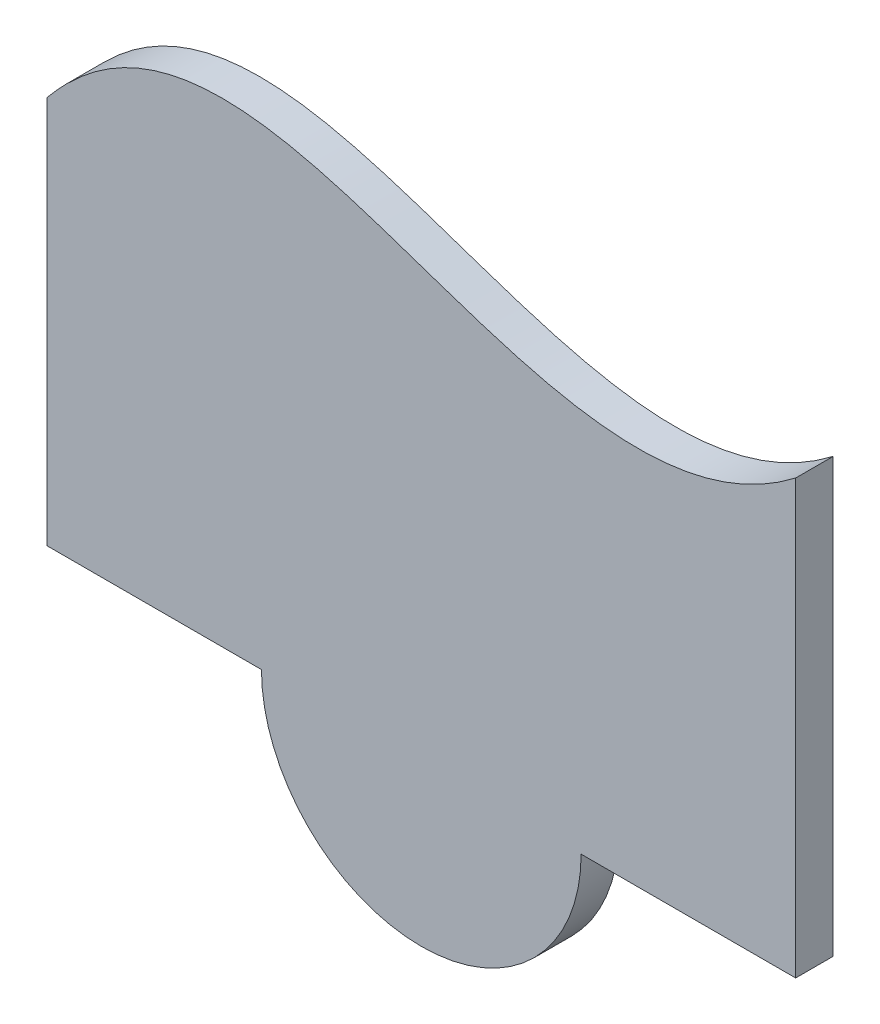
ISO-10303-21;
HEADER;
FILE_DESCRIPTION(('STEP AP214'),'2;1');
FILE_NAME('part.step','',(''),(''),'','','');
FILE_SCHEMA(('AUTOMOTIVE_DESIGN { 1 0 10303 214 1 1 1 1 }'));
ENDSEC;
DATA;
#1=APPLICATION_CONTEXT('core data for automotive mechanical design processes');
#2=APPLICATION_PROTOCOL_DEFINITION('international standard','automotive_design',2000,#1);
#3=PRODUCT_CONTEXT('',#1,'mechanical');
#4=PRODUCT('Part','Part','',(#3));
#5=PRODUCT_RELATED_PRODUCT_CATEGORY('part','',(#4));
#6=PRODUCT_DEFINITION_FORMATION('','',#4);
#7=PRODUCT_DEFINITION_CONTEXT('part definition',#1,'design');
#8=PRODUCT_DEFINITION('design','',#6,#7);
#9=PRODUCT_DEFINITION_SHAPE('','',#8);
#10=(LENGTH_UNIT() NAMED_UNIT(*) SI_UNIT(.MILLI.,.METRE.));
#11=(NAMED_UNIT(*) PLANE_ANGLE_UNIT() SI_UNIT($,.RADIAN.));
#12=(NAMED_UNIT(*) SI_UNIT($,.STERADIAN.) SOLID_ANGLE_UNIT());
#13=UNCERTAINTY_MEASURE_WITH_UNIT(LENGTH_MEASURE(1.E-05),#10,'distance_accuracy_value','');
#14=(GEOMETRIC_REPRESENTATION_CONTEXT(3) GLOBAL_UNCERTAINTY_ASSIGNED_CONTEXT((#13)) GLOBAL_UNIT_ASSIGNED_CONTEXT((#10,
#11,#12)) REPRESENTATION_CONTEXT('',''));
#15=CARTESIAN_POINT('',(0.,0.,0.));
#16=DIRECTION('',(0.,0.,1.));
#17=DIRECTION('',(1.,0.,0.));
#18=AXIS2_PLACEMENT_3D('',#15,#16,#17);
#19=CARTESIAN_POINT('',(0.,0.,5.));
#20=DIRECTION('',(1.,0.,0.));
#21=DIRECTION('',(0.,0.,-1.));
#22=AXIS2_PLACEMENT_3D('',#19,#20,#21);
#23=PLANE('',#22);
#24=DIRECTION('',(0.,-1.,0.));
#25=VECTOR('',#24,1.);
#26=CARTESIAN_POINT('',(0.,0.,0.));
#27=LINE('',#26,#25);
#28=CARTESIAN_POINT('',(0.,51.8211013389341,0.));
#29=VERTEX_POINT('',#28);
#30=CARTESIAN_POINT('',(0.,0.,0.));
#31=VERTEX_POINT('',#30);
#32=EDGE_CURVE('E120',#29,#31,#27,.T.);
#33=ORIENTED_EDGE('',*,*,#32,.T.);
#34=DIRECTION('',(0.,0.,-1.));
#35=VECTOR('',#34,1.);
#36=CARTESIAN_POINT('',(0.,0.,5.));
#37=LINE('',#36,#35);
#38=CARTESIAN_POINT('',(0.,0.,5.));
#39=VERTEX_POINT('',#38);
#40=EDGE_CURVE('E11',#39,#31,#37,.T.);
#41=ORIENTED_EDGE('',*,*,#40,.F.);
#42=DIRECTION('',(0.,-1.,0.));
#43=VECTOR('',#42,1.);
#44=CARTESIAN_POINT('',(0.,0.,5.));
#45=LINE('',#44,#43);
#46=CARTESIAN_POINT('',(0.,51.8211013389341,5.));
#47=VERTEX_POINT('',#46);
#48=EDGE_CURVE('E160',#47,#39,#45,.T.);
#49=ORIENTED_EDGE('',*,*,#48,.F.);
#50=DIRECTION('',(0.,0.,-1.));
#51=VECTOR('',#50,1.);
#52=CARTESIAN_POINT('',(0.,51.8211013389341,5.));
#53=LINE('',#52,#51);
#54=EDGE_CURVE('E113',#47,#29,#53,.T.);
#55=ORIENTED_EDGE('',*,*,#54,.T.);
#56=EDGE_LOOP('',(#33,#41,#49,#55));
#57=FACE_BOUND('',#56,.T.);
#58=ADVANCED_FACE('F33',(#57),#23,.F.);
#59=CARTESIAN_POINT('',(0.,0.,5.));
#60=DIRECTION('',(0.,1.,0.));
#61=DIRECTION('',(0.,0.,1.));
#62=AXIS2_PLACEMENT_3D('',#59,#60,#61);
#63=PLANE('',#62);
#64=DIRECTION('',(1.,0.,0.));
#65=VECTOR('',#64,1.);
#66=CARTESIAN_POINT('',(0.,0.,0.));
#67=LINE('',#66,#65);
#68=CARTESIAN_POINT('',(28.6521068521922,0.,0.));
#69=VERTEX_POINT('',#68);
#70=EDGE_CURVE('E145',#31,#69,#67,.T.);
#71=ORIENTED_EDGE('',*,*,#70,.T.);
#72=DIRECTION('',(0.,0.,-1.));
#73=VECTOR('',#72,1.);
#74=CARTESIAN_POINT('',(28.6521068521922,0.,5.));
#75=LINE('',#74,#73);
#76=CARTESIAN_POINT('',(28.6521068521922,0.,5.));
#77=VERTEX_POINT('',#76);
#78=EDGE_CURVE('E41',#77,#69,#75,.T.);
#79=ORIENTED_EDGE('',*,*,#78,.F.);
#80=DIRECTION('',(1.,0.,0.));
#81=VECTOR('',#80,1.);
#82=CARTESIAN_POINT('',(0.,0.,5.));
#83=LINE('',#82,#81);
#84=EDGE_CURVE('E86',#39,#77,#83,.T.);
#85=ORIENTED_EDGE('',*,*,#84,.F.);
#86=ORIENTED_EDGE('',*,*,#40,.T.);
#87=EDGE_LOOP('',(#71,#79,#85,#86));
#88=FACE_BOUND('',#87,.T.);
#89=ADVANCED_FACE('F138',(#88),#63,.F.);
#90=CARTESIAN_POINT('',(50.,0.,5.));
#91=DIRECTION('',(0.,0.,-1.));
#92=DIRECTION('',(-1.,0.,0.));
#93=AXIS2_PLACEMENT_3D('',#90,#91,#92);
#94=CYLINDRICAL_SURFACE('',#93,21.3478931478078);
#95=CARTESIAN_POINT('',(50.,0.,0.));
#96=DIRECTION('',(0.,0.,1.));
#97=DIRECTION('',(-1.,0.,0.));
#98=AXIS2_PLACEMENT_3D('',#95,#96,#97);
#99=CIRCLE('',#98,21.3478931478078);
#100=CARTESIAN_POINT('',(71.3478931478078,0.,0.));
#101=VERTEX_POINT('',#100);
#102=EDGE_CURVE('E152',#69,#101,#99,.T.);
#103=ORIENTED_EDGE('',*,*,#102,.T.);
#104=DIRECTION('',(0.,0.,-1.));
#105=VECTOR('',#104,1.);
#106=CARTESIAN_POINT('',(71.3478931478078,0.,5.));
#107=LINE('',#106,#105);
#108=CARTESIAN_POINT('',(71.3478931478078,0.,5.));
#109=VERTEX_POINT('',#108);
#110=EDGE_CURVE('E108',#109,#101,#107,.T.);
#111=ORIENTED_EDGE('',*,*,#110,.F.);
#112=CARTESIAN_POINT('',(50.,0.,5.));
#113=DIRECTION('',(0.,0.,1.));
#114=DIRECTION('',(-1.,0.,0.));
#115=AXIS2_PLACEMENT_3D('',#112,#113,#114);
#116=CIRCLE('',#115,21.3478931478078);
#117=EDGE_CURVE('E99',#77,#109,#116,.T.);
#118=ORIENTED_EDGE('',*,*,#117,.F.);
#119=ORIENTED_EDGE('',*,*,#78,.T.);
#120=EDGE_LOOP('',(#103,#111,#118,#119));
#121=FACE_BOUND('',#120,.T.);
#122=ADVANCED_FACE('F136',(#121),#94,.T.);
#123=CARTESIAN_POINT('',(71.3478931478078,0.,5.));
#124=DIRECTION('',(0.,1.,0.));
#125=DIRECTION('',(0.,0.,1.));
#126=AXIS2_PLACEMENT_3D('',#123,#124,#125);
#127=PLANE('',#126);
#128=DIRECTION('',(1.,0.,0.));
#129=VECTOR('',#128,1.);
#130=CARTESIAN_POINT('',(71.3478931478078,0.,0.));
#131=LINE('',#130,#129);
#132=CARTESIAN_POINT('',(100.,0.,0.));
#133=VERTEX_POINT('',#132);
#134=EDGE_CURVE('E107',#101,#133,#131,.T.);
#135=ORIENTED_EDGE('',*,*,#134,.T.);
#136=DIRECTION('',(0.,0.,-1.));
#137=VECTOR('',#136,1.);
#138=CARTESIAN_POINT('',(100.,0.,5.));
#139=LINE('',#138,#137);
#140=CARTESIAN_POINT('',(100.,0.,5.));
#141=VERTEX_POINT('',#140);
#142=EDGE_CURVE('E104',#141,#133,#139,.T.);
#143=ORIENTED_EDGE('',*,*,#142,.F.);
#144=DIRECTION('',(1.,0.,0.));
#145=VECTOR('',#144,1.);
#146=CARTESIAN_POINT('',(71.3478931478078,0.,5.));
#147=LINE('',#146,#145);
#148=EDGE_CURVE('E93',#109,#141,#147,.T.);
#149=ORIENTED_EDGE('',*,*,#148,.F.);
#150=ORIENTED_EDGE('',*,*,#110,.T.);
#151=EDGE_LOOP('',(#135,#143,#149,#150));
#152=FACE_BOUND('',#151,.T.);
#153=ADVANCED_FACE('F105',(#152),#127,.F.);
#154=CARTESIAN_POINT('',(100.,0.,5.));
#155=DIRECTION('',(-1.,0.,0.));
#156=DIRECTION('',(0.,0.,1.));
#157=AXIS2_PLACEMENT_3D('',#154,#155,#156);
#158=PLANE('',#157);
#159=DIRECTION('',(0.,1.,0.));
#160=VECTOR('',#159,1.);
#161=CARTESIAN_POINT('',(100.,0.,0.));
#162=LINE('',#161,#160);
#163=CARTESIAN_POINT('',(100.,57.8293449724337,0.));
#164=VERTEX_POINT('',#163);
#165=EDGE_CURVE('E72',#133,#164,#162,.T.);
#166=ORIENTED_EDGE('',*,*,#165,.T.);
#167=DIRECTION('',(0.,0.,-1.));
#168=VECTOR('',#167,1.);
#169=CARTESIAN_POINT('',(100.,57.8293449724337,5.));
#170=LINE('',#169,#168);
#171=CARTESIAN_POINT('',(100.,57.8293449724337,5.));
#172=VERTEX_POINT('',#171);
#173=EDGE_CURVE('E109',#172,#164,#170,.T.);
#174=ORIENTED_EDGE('',*,*,#173,.F.);
#175=DIRECTION('',(0.,1.,0.));
#176=VECTOR('',#175,1.);
#177=CARTESIAN_POINT('',(100.,0.,5.));
#178=LINE('',#177,#176);
#179=EDGE_CURVE('E97',#141,#172,#178,.T.);
#180=ORIENTED_EDGE('',*,*,#179,.F.);
#181=ORIENTED_EDGE('',*,*,#142,.T.);
#182=EDGE_LOOP('',(#166,#174,#180,#181));
#183=FACE_BOUND('',#182,.T.);
#184=ADVANCED_FACE('F111',(#183),#158,.F.);
#185=CARTESIAN_POINT('',(100.,57.8293449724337,5.));
#186=CARTESIAN_POINT('',(66.9714049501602,32.496610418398,5.));
#187=CARTESIAN_POINT('',(27.7324583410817,85.6344200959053,5.));
#188=CARTESIAN_POINT('',(0.,51.8211013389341,5.));
#189=B_SPLINE_CURVE_WITH_KNOTS('',3,(#185,#186,#187,#188),.UNSPECIFIED.,.F.,.F.,(4,4),(0.,1.),.UNSPECIFIED.);
#190=DIRECTION('',(0.,0.,-1.));
#191=VECTOR('',#190,1.);
#192=SURFACE_OF_LINEAR_EXTRUSION('',#189,#191);
#193=CARTESIAN_POINT('',(100.,57.8293449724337,0.));
#194=CARTESIAN_POINT('',(66.9714049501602,32.496610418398,0.));
#195=CARTESIAN_POINT('',(27.7324583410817,85.6344200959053,0.));
#196=CARTESIAN_POINT('',(0.,51.8211013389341,0.));
#197=B_SPLINE_CURVE_WITH_KNOTS('',3,(#193,#194,#195,#196),.UNSPECIFIED.,.F.,.F.,(4,4),(0.,1.),.UNSPECIFIED.);
#198=EDGE_CURVE('E78',#164,#29,#197,.T.);
#199=ORIENTED_EDGE('',*,*,#198,.T.);
#200=ORIENTED_EDGE('',*,*,#54,.F.);
#201=EDGE_CURVE('E49',#172,#47,#189,.T.);
#202=ORIENTED_EDGE('',*,*,#201,.F.);
#203=ORIENTED_EDGE('',*,*,#173,.T.);
#204=EDGE_LOOP('',(#199,#200,#202,#203));
#205=FACE_BOUND('',#204,.T.);
#206=ADVANCED_FACE('F126',(#205),#192,.F.);
#207=CARTESIAN_POINT('',(48.0139487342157,58.0054422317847,5.));
#208=DIRECTION('',(0.,0.,1.));
#209=DIRECTION('',(1.,0.,0.));
#210=AXIS2_PLACEMENT_3D('',#207,#208,#209);
#211=PLANE('',#210);
#212=ORIENTED_EDGE('',*,*,#48,.T.);
#213=ORIENTED_EDGE('',*,*,#84,.T.);
#214=ORIENTED_EDGE('',*,*,#117,.T.);
#215=ORIENTED_EDGE('',*,*,#148,.T.);
#216=ORIENTED_EDGE('',*,*,#179,.T.);
#217=ORIENTED_EDGE('',*,*,#201,.T.);
#218=EDGE_LOOP('',(#212,#213,#214,#215,#216,#217));
#219=FACE_BOUND('',#218,.T.);
#220=ADVANCED_FACE('F95',(#219),#211,.T.);
#221=CARTESIAN_POINT('',(48.0139487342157,58.0054422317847,0.));
#222=DIRECTION('',(0.,0.,1.));
#223=DIRECTION('',(1.,0.,0.));
#224=AXIS2_PLACEMENT_3D('',#221,#222,#223);
#225=PLANE('',#224);
#226=ORIENTED_EDGE('',*,*,#32,.F.);
#227=ORIENTED_EDGE('',*,*,#198,.F.);
#228=ORIENTED_EDGE('',*,*,#165,.F.);
#229=ORIENTED_EDGE('',*,*,#134,.F.);
#230=ORIENTED_EDGE('',*,*,#102,.F.);
#231=ORIENTED_EDGE('',*,*,#70,.F.);
#232=EDGE_LOOP('',(#226,#227,#228,#229,#230,#231));
#233=FACE_BOUND('',#232,.T.);
#234=ADVANCED_FACE('F130',(#233),#225,.F.);
#235=CLOSED_SHELL('',(#58,#89,#122,#153,#184,#206,#220,#234));
#236=MANIFOLD_SOLID_BREP('B2',#235);
#237=ADVANCED_BREP_SHAPE_REPRESENTATION('',(#18,#236),#14);
#238=SHAPE_DEFINITION_REPRESENTATION(#9,#237);
ENDSEC;
END-ISO-10303-21;
